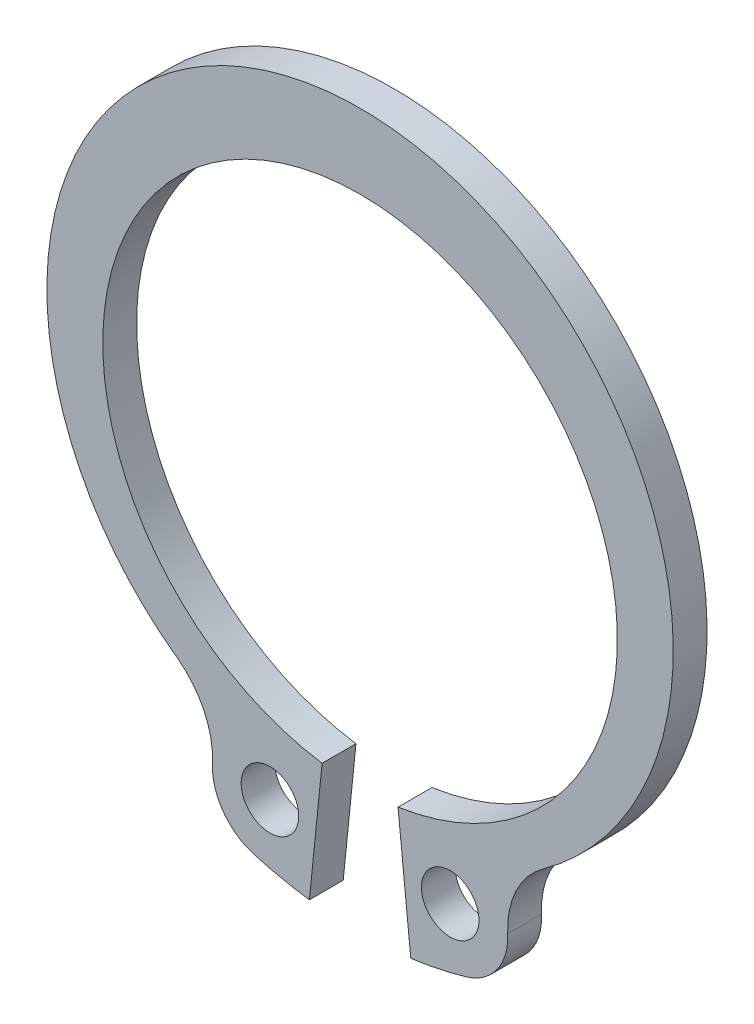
from build123d import *

# Parameters (mm, degrees)
ESQUISSE1_R          = 0.85
BASE_EXTRUSION_DEPTH = 1


with BuildPart() as part:
    # Esquisse1 → Base-Extrusion (new body)
    with BuildSketch(Plane.XY):
        with BuildLine():
            Line((1.121409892, -7.516810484), (1.497492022, -11.197647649))
            ThreePointArc((1.497492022, -11.197647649), (2.322216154, -11.056089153), (3.134200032, -10.853874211))
            ThreePointArc((3.134200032, -10.853874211), (4.045320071, -10.209548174), (4.360616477, -9.139088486))
            ThreePointArc((4.360616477, -9.139088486), (4.610134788, -7.910571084), (5.414921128, -6.949408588))
            ThreePointArc((5.414921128, -6.949408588), (0, 9.8), (-5.414921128, -6.949408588))
            ThreePointArc((-5.414921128, -6.949408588), (-4.610134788, -7.910571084), (-4.360616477, -9.139088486))
            ThreePointArc((-4.360616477, -9.139088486), (-4.045320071, -10.209548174), (-3.134200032, -10.853874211))
            ThreePointArc((-3.134200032, -10.853874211), (-2.322216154, -11.056089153), (-1.497492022, -11.197647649))
            Line((-1.497492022, -11.197647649), (-1.121409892, -7.516810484))
            ThreePointArc((-1.121409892, -7.516810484), (0, 7.6), (1.121409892, -7.516810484))
        make_face()
        with Locations((2.662572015, -9.220605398)):
            Circle(ESQUISSE1_R, mode=Mode.SUBTRACT)
        with Locations(Location((-2.662572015, -9.220605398, 0), (0, 0, 180))):
            Circle(ESQUISSE1_R, mode=Mode.SUBTRACT)
    extrude(amount=BASE_EXTRUSION_DEPTH)


solid = part.part
